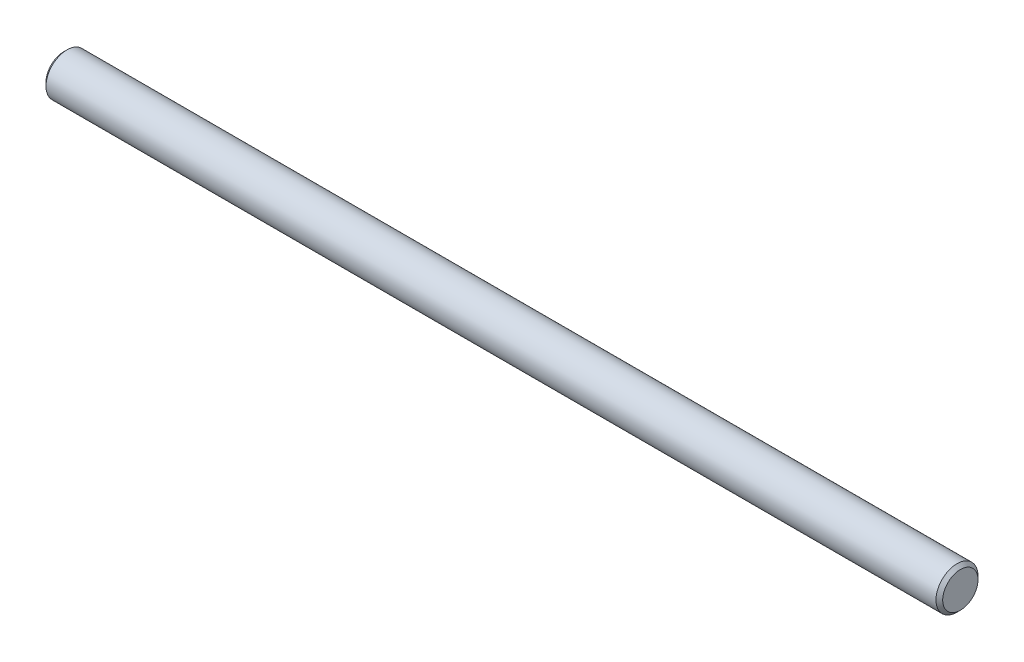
ISO-10303-21;
HEADER;
FILE_DESCRIPTION(('STEP AP214'),'2;1');
FILE_NAME('part.step','',(''),(''),'','','');
FILE_SCHEMA(('AUTOMOTIVE_DESIGN { 1 0 10303 214 1 1 1 1 }'));
ENDSEC;
DATA;
#1=APPLICATION_CONTEXT('core data for automotive mechanical design processes');
#2=APPLICATION_PROTOCOL_DEFINITION('international standard','automotive_design',2000,#1);
#3=PRODUCT_CONTEXT('',#1,'mechanical');
#4=PRODUCT('Part','Part','',(#3));
#5=PRODUCT_RELATED_PRODUCT_CATEGORY('part','',(#4));
#6=PRODUCT_DEFINITION_FORMATION('','',#4);
#7=PRODUCT_DEFINITION_CONTEXT('part definition',#1,'design');
#8=PRODUCT_DEFINITION('design','',#6,#7);
#9=PRODUCT_DEFINITION_SHAPE('','',#8);
#10=(LENGTH_UNIT() NAMED_UNIT(*) SI_UNIT(.MILLI.,.METRE.));
#11=(NAMED_UNIT(*) PLANE_ANGLE_UNIT() SI_UNIT($,.RADIAN.));
#12=(NAMED_UNIT(*) SI_UNIT($,.STERADIAN.) SOLID_ANGLE_UNIT());
#13=UNCERTAINTY_MEASURE_WITH_UNIT(LENGTH_MEASURE(1.E-05),#10,'distance_accuracy_value','');
#14=(GEOMETRIC_REPRESENTATION_CONTEXT(3) GLOBAL_UNCERTAINTY_ASSIGNED_CONTEXT((#13)) GLOBAL_UNIT_ASSIGNED_CONTEXT((#10,
#11,#12)) REPRESENTATION_CONTEXT('',''));
#15=CARTESIAN_POINT('',(0.,0.,0.));
#16=DIRECTION('',(0.,0.,1.));
#17=DIRECTION('',(1.,0.,0.));
#18=AXIS2_PLACEMENT_3D('',#15,#16,#17);
#19=CARTESIAN_POINT('',(50.8,0.,0.));
#20=DIRECTION('',(-1.,0.,0.));
#21=DIRECTION('',(0.,0.,1.));
#22=AXIS2_PLACEMENT_3D('',#19,#20,#21);
#23=CYLINDRICAL_SURFACE('',#22,2.38125);
#24=CARTESIAN_POINT('',(50.419,0.,0.));
#25=DIRECTION('',(1.,0.,0.));
#26=DIRECTION('',(0.,0.,-1.));
#27=AXIS2_PLACEMENT_3D('',#24,#25,#26);
#28=CIRCLE('',#27,2.38125);
#29=CARTESIAN_POINT('',(50.419,0.,-2.38125));
#30=VERTEX_POINT('',#29);
#31=EDGE_CURVE('E36',#30,#30,#28,.F.);
#32=ORIENTED_EDGE('',*,*,#31,.T.);
#33=EDGE_LOOP('',(#32));
#34=FACE_BOUND('',#33,.T.);
#35=CARTESIAN_POINT('',(-50.419,0.,0.));
#36=DIRECTION('',(1.,0.,0.));
#37=DIRECTION('',(0.,0.,-1.));
#38=AXIS2_PLACEMENT_3D('',#35,#36,#37);
#39=CIRCLE('',#38,2.38125);
#40=CARTESIAN_POINT('',(-50.419,0.,-2.38125));
#41=VERTEX_POINT('',#40);
#42=EDGE_CURVE('E40',#41,#41,#39,.T.);
#43=ORIENTED_EDGE('',*,*,#42,.T.);
#44=EDGE_LOOP('',(#43));
#45=FACE_BOUND('',#44,.T.);
#46=ADVANCED_FACE('F30',(#34,#45),#23,.T.);
#47=CARTESIAN_POINT('',(50.8,0.,0.));
#48=DIRECTION('',(1.,0.,0.));
#49=DIRECTION('',(0.,0.,-1.));
#50=AXIS2_PLACEMENT_3D('',#47,#48,#49);
#51=PLANE('',#50);
#52=CARTESIAN_POINT('',(50.8,0.,0.));
#53=DIRECTION('',(1.,0.,0.));
#54=DIRECTION('',(0.,0.,-1.));
#55=AXIS2_PLACEMENT_3D('',#52,#53,#54);
#56=CIRCLE('',#55,2.00025);
#57=CARTESIAN_POINT('',(50.8,0.,-2.00025));
#58=VERTEX_POINT('',#57);
#59=EDGE_CURVE('E44',#58,#58,#56,.T.);
#60=ORIENTED_EDGE('',*,*,#59,.T.);
#61=EDGE_LOOP('',(#60));
#62=FACE_BOUND('',#61,.T.);
#63=ADVANCED_FACE('F50',(#62),#51,.T.);
#64=CARTESIAN_POINT('',(-50.8,0.,0.));
#65=DIRECTION('',(1.,0.,0.));
#66=DIRECTION('',(0.,0.,-1.));
#67=AXIS2_PLACEMENT_3D('',#64,#65,#66);
#68=PLANE('',#67);
#69=CARTESIAN_POINT('',(-50.8,0.,0.));
#70=DIRECTION('',(1.,0.,0.));
#71=DIRECTION('',(0.,0.,-1.));
#72=AXIS2_PLACEMENT_3D('',#69,#70,#71);
#73=CIRCLE('',#72,2.00025);
#74=CARTESIAN_POINT('',(-50.8,0.,-2.00024999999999));
#75=VERTEX_POINT('',#74);
#76=EDGE_CURVE('E10',#75,#75,#73,.F.);
#77=ORIENTED_EDGE('',*,*,#76,.T.);
#78=EDGE_LOOP('',(#77));
#79=FACE_BOUND('',#78,.T.);
#80=ADVANCED_FACE('F55',(#79),#68,.F.);
#81=CARTESIAN_POINT('',(50.8,0.,0.));
#82=DIRECTION('',(-1.,0.,0.));
#83=DIRECTION('',(0.,0.,1.));
#84=AXIS2_PLACEMENT_3D('',#81,#82,#83);
#85=CONICAL_SURFACE('',#84,2.00025,0.785398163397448);
#86=ORIENTED_EDGE('',*,*,#31,.F.);
#87=EDGE_LOOP('',(#86));
#88=FACE_BOUND('',#87,.T.);
#89=ORIENTED_EDGE('',*,*,#59,.F.);
#90=EDGE_LOOP('',(#89));
#91=FACE_BOUND('',#90,.T.);
#92=ADVANCED_FACE('F52',(#88,#91),#85,.T.);
#93=CARTESIAN_POINT('',(-50.419,0.,0.));
#94=DIRECTION('',(1.,0.,0.));
#95=DIRECTION('',(0.,0.,-1.));
#96=AXIS2_PLACEMENT_3D('',#93,#94,#95);
#97=CONICAL_SURFACE('',#96,2.38125,0.785398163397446);
#98=CARTESIAN_POINT('',(-50.8,0.,-2.00024999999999));
#99=CARTESIAN_POINT('',(-50.79603125,0.,-2.00421874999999));
#100=CARTESIAN_POINT('',(-50.7920625,0.,-2.00818749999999));
#101=CARTESIAN_POINT('',(-50.784125,0.,-2.01612499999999));
#102=CARTESIAN_POINT('',(-50.78015625,0.,-2.02009374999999));
#103=CARTESIAN_POINT('',(-50.77221875,0.,-2.02803124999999));
#104=CARTESIAN_POINT('',(-50.76825,0.,-2.03199999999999));
#105=CARTESIAN_POINT('',(-50.7603125,0.,-2.03993749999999));
#106=CARTESIAN_POINT('',(-50.75634375,0.,-2.04390624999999));
#107=CARTESIAN_POINT('',(-50.74840625,0.,-2.05184374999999));
#108=CARTESIAN_POINT('',(-50.7444375,0.,-2.05581249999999));
#109=CARTESIAN_POINT('',(-50.7365,0.,-2.06374999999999));
#110=CARTESIAN_POINT('',(-50.73253125,0.,-2.06771874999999));
#111=CARTESIAN_POINT('',(-50.72459375,0.,-2.07565624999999));
#112=CARTESIAN_POINT('',(-50.720625,0.,-2.07962499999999));
#113=CARTESIAN_POINT('',(-50.7126875,0.,-2.08756249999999));
#114=CARTESIAN_POINT('',(-50.70871875,0.,-2.09153124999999));
#115=CARTESIAN_POINT('',(-50.70078125,0.,-2.09946874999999));
#116=CARTESIAN_POINT('',(-50.6968125,0.,-2.10343749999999));
#117=CARTESIAN_POINT('',(-50.688875,0.,-2.11137499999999));
#118=CARTESIAN_POINT('',(-50.68490625,0.,-2.11534374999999));
#119=CARTESIAN_POINT('',(-50.67696875,0.,-2.12328124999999));
#120=CARTESIAN_POINT('',(-50.673,0.,-2.12724999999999));
#121=CARTESIAN_POINT('',(-50.6650625,0.,-2.13518749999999));
#122=CARTESIAN_POINT('',(-50.66109375,0.,-2.13915624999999));
#123=CARTESIAN_POINT('',(-50.65315625,0.,-2.14709374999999));
#124=CARTESIAN_POINT('',(-50.6491875,0.,-2.15106249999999));
#125=CARTESIAN_POINT('',(-50.64125,0.,-2.15899999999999));
#126=CARTESIAN_POINT('',(-50.63728125,0.,-2.16296874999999));
#127=CARTESIAN_POINT('',(-50.62934375,0.,-2.17090624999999));
#128=CARTESIAN_POINT('',(-50.625375,0.,-2.17487499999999));
#129=CARTESIAN_POINT('',(-50.6174375,0.,-2.18281249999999));
#130=CARTESIAN_POINT('',(-50.61346875,0.,-2.18678124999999));
#131=CARTESIAN_POINT('',(-50.60553125,0.,-2.19471874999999));
#132=CARTESIAN_POINT('',(-50.6015625,0.,-2.19868749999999));
#133=CARTESIAN_POINT('',(-50.593625,0.,-2.20662499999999));
#134=CARTESIAN_POINT('',(-50.58965625,0.,-2.21059374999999));
#135=CARTESIAN_POINT('',(-50.58171875,0.,-2.21853124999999));
#136=CARTESIAN_POINT('',(-50.57775,0.,-2.22249999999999));
#137=CARTESIAN_POINT('',(-50.5698125,0.,-2.23043749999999));
#138=CARTESIAN_POINT('',(-50.56584375,0.,-2.23440624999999));
#139=CARTESIAN_POINT('',(-50.55790625,0.,-2.24234375));
#140=CARTESIAN_POINT('',(-50.5539375,0.,-2.2463125));
#141=CARTESIAN_POINT('',(-50.546,0.,-2.25425));
#142=CARTESIAN_POINT('',(-50.54203125,0.,-2.25821874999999));
#143=CARTESIAN_POINT('',(-50.53409375,0.,-2.26615624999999));
#144=CARTESIAN_POINT('',(-50.530125,0.,-2.27012499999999));
#145=CARTESIAN_POINT('',(-50.5221875,0.,-2.2780625));
#146=CARTESIAN_POINT('',(-50.51821875,0.,-2.28203124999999));
#147=CARTESIAN_POINT('',(-50.51028125,0.,-2.28996875));
#148=CARTESIAN_POINT('',(-50.5063125,0.,-2.2939375));
#149=CARTESIAN_POINT('',(-50.498375,0.,-2.301875));
#150=CARTESIAN_POINT('',(-50.49440625,0.,-2.30584375));
#151=CARTESIAN_POINT('',(-50.48646875,0.,-2.31378125));
#152=CARTESIAN_POINT('',(-50.4825,0.,-2.31775));
#153=CARTESIAN_POINT('',(-50.4745625,0.,-2.3256875));
#154=CARTESIAN_POINT('',(-50.47059375,0.,-2.32965625));
#155=CARTESIAN_POINT('',(-50.46265625,0.,-2.33759375));
#156=CARTESIAN_POINT('',(-50.4586875,0.,-2.3415625));
#157=CARTESIAN_POINT('',(-50.45075,0.,-2.3495));
#158=CARTESIAN_POINT('',(-50.44678125,0.,-2.35346875));
#159=CARTESIAN_POINT('',(-50.43884375,0.,-2.36140625));
#160=CARTESIAN_POINT('',(-50.434875,0.,-2.365375));
#161=CARTESIAN_POINT('',(-50.4269375,0.,-2.3733125));
#162=CARTESIAN_POINT('',(-50.42296875,0.,-2.37728125));
#163=CARTESIAN_POINT('',(-50.419,0.,-2.38125));
#164=B_SPLINE_CURVE_WITH_KNOTS('',3,(#98,#99,#100,#101,#102,#103,#104,#105,#106,#107,#108,#109,
#110,#111,#112,#113,#114,#115,#116,#117,#118,#119,#120,#121,#122,#123,#124,#125,#126,#127,#128,
#129,#130,#131,#132,#133,#134,#135,#136,#137,#138,#139,#140,#141,#142,#143,#144,#145,#146,#147,
#148,#149,#150,#151,#152,#153,#154,#155,#156,#157,#158,#159,#160,#161,#162,#163),.UNSPECIFIED.,
.F.,.F.,(4,2,2,2,2,2,2,2,2,2,2,2,2,2,2,2,2,2,2,2,2,2,2,2,2,2,2,2,2,2,2,2,4),(0.,
0.0168379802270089,0.0336759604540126,0.0505139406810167,0.0673519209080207,0.0841899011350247,
0.101027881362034,0.117865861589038,0.134703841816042,0.151541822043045,0.168379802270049,
0.185217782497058,0.202055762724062,0.218893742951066,0.23573172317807,0.252569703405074,
0.269407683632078,0.286245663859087,0.303083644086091,0.319921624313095,0.336759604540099,
0.353597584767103,0.370435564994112,0.387273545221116,0.40411152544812,0.420949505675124,
0.437787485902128,0.454625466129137,0.471463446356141,0.488301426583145,0.505139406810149,
0.521977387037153,0.538815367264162),.UNSPECIFIED.);
#165=EDGE_CURVE('BSEAM54',#75,#41,#164,.T.);
#166=ORIENTED_EDGE('',*,*,#76,.F.);
#167=ORIENTED_EDGE('',*,*,#42,.F.);
#168=ORIENTED_EDGE('',*,*,#165,.T.);
#169=ORIENTED_EDGE('',*,*,#165,.F.);
#170=EDGE_LOOP('',(#166,#168,#167,#169));
#171=FACE_BOUND('',#170,.T.);
#172=ADVANCED_FACE('F54',(#171),#97,.T.);
#173=CLOSED_SHELL('',(#46,#63,#80,#92,#172));
#174=MANIFOLD_SOLID_BREP('B2',#173);
#175=ADVANCED_BREP_SHAPE_REPRESENTATION('',(#18,#174),#14);
#176=SHAPE_DEFINITION_REPRESENTATION(#9,#175);
ENDSEC;
END-ISO-10303-21;
